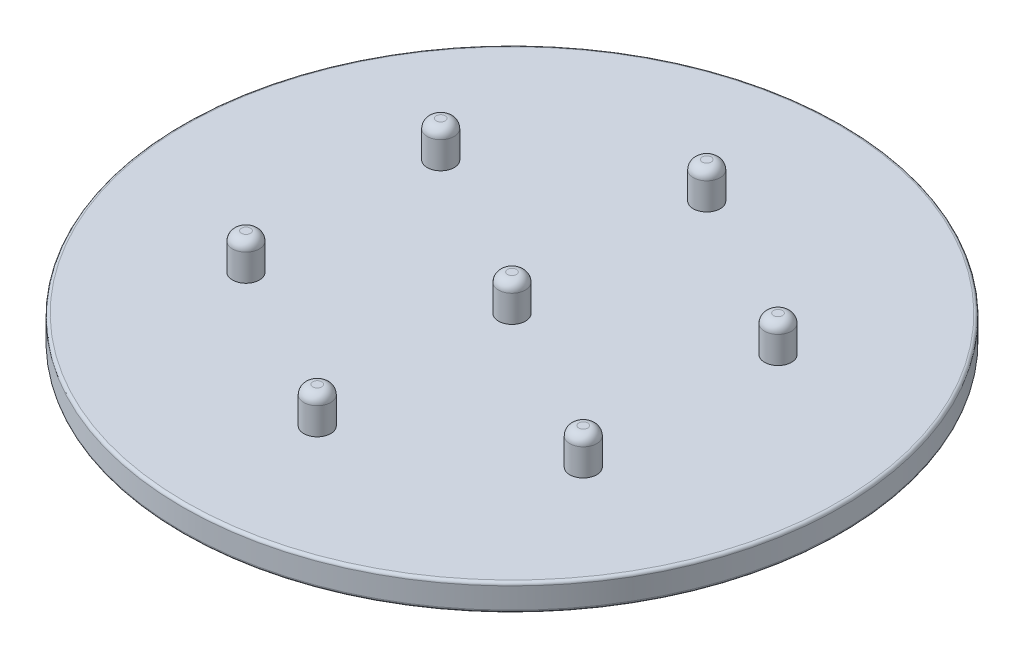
ISO-10303-21;
HEADER;
FILE_DESCRIPTION(('STEP AP214'),'2;1');
FILE_NAME('part.step','',(''),(''),'','','');
FILE_SCHEMA(('AUTOMOTIVE_DESIGN { 1 0 10303 214 1 1 1 1 }'));
ENDSEC;
DATA;
#1=APPLICATION_CONTEXT('core data for automotive mechanical design processes');
#2=APPLICATION_PROTOCOL_DEFINITION('international standard','automotive_design',2000,#1);
#3=PRODUCT_CONTEXT('',#1,'mechanical');
#4=PRODUCT('Part','Part','',(#3));
#5=PRODUCT_RELATED_PRODUCT_CATEGORY('part','',(#4));
#6=PRODUCT_DEFINITION_FORMATION('','',#4);
#7=PRODUCT_DEFINITION_CONTEXT('part definition',#1,'design');
#8=PRODUCT_DEFINITION('design','',#6,#7);
#9=PRODUCT_DEFINITION_SHAPE('','',#8);
#10=(LENGTH_UNIT() NAMED_UNIT(*) SI_UNIT(.MILLI.,.METRE.));
#11=(NAMED_UNIT(*) PLANE_ANGLE_UNIT() SI_UNIT($,.RADIAN.));
#12=(NAMED_UNIT(*) SI_UNIT($,.STERADIAN.) SOLID_ANGLE_UNIT());
#13=UNCERTAINTY_MEASURE_WITH_UNIT(LENGTH_MEASURE(1.E-05),#10,'distance_accuracy_value','');
#14=(GEOMETRIC_REPRESENTATION_CONTEXT(3) GLOBAL_UNCERTAINTY_ASSIGNED_CONTEXT((#13)) GLOBAL_UNIT_ASSIGNED_CONTEXT((#10,
#11,#12)) REPRESENTATION_CONTEXT('',''));
#15=CARTESIAN_POINT('',(0.,0.,0.));
#16=DIRECTION('',(0.,0.,1.));
#17=DIRECTION('',(1.,0.,0.));
#18=AXIS2_PLACEMENT_3D('',#15,#16,#17);
#19=CARTESIAN_POINT('',(0.,-9.,0.));
#20=DIRECTION('',(0.,1.,0.));
#21=DIRECTION('',(0.,0.,1.));
#22=AXIS2_PLACEMENT_3D('',#19,#20,#21);
#23=CYLINDRICAL_SURFACE('',#22,110.);
#24=CARTESIAN_POINT('',(0.,-8.,0.));
#25=DIRECTION('',(0.,1.,0.));
#26=DIRECTION('',(0.,0.,1.));
#27=AXIS2_PLACEMENT_3D('',#24,#25,#26);
#28=CIRCLE('',#27,110.);
#29=CARTESIAN_POINT('',(0.,-8.,110.));
#30=VERTEX_POINT('',#29);
#31=EDGE_CURVE('E45',#30,#30,#28,.T.);
#32=ORIENTED_EDGE('',*,*,#31,.T.);
#33=EDGE_LOOP('',(#32));
#34=FACE_BOUND('',#33,.T.);
#35=CARTESIAN_POINT('',(0.,-0.999999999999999,0.));
#36=DIRECTION('',(0.,1.,0.));
#37=DIRECTION('',(0.,0.,1.));
#38=AXIS2_PLACEMENT_3D('',#35,#36,#37);
#39=CIRCLE('',#38,110.);
#40=CARTESIAN_POINT('',(0.,-0.999999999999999,110.));
#41=VERTEX_POINT('',#40);
#42=EDGE_CURVE('E49',#41,#41,#39,.F.);
#43=ORIENTED_EDGE('',*,*,#42,.T.);
#44=EDGE_LOOP('',(#43));
#45=FACE_BOUND('',#44,.T.);
#46=ADVANCED_FACE('F34',(#34,#45),#23,.T.);
#47=CARTESIAN_POINT('',(0.,-9.,0.));
#48=DIRECTION('',(0.,1.,0.));
#49=DIRECTION('',(0.,0.,1.));
#50=AXIS2_PLACEMENT_3D('',#47,#48,#49);
#51=PLANE('',#50);
#52=CARTESIAN_POINT('',(0.,-9.,0.));
#53=DIRECTION('',(0.,1.,0.));
#54=DIRECTION('',(0.,0.,1.));
#55=AXIS2_PLACEMENT_3D('',#52,#53,#54);
#56=CIRCLE('',#55,109.);
#57=CARTESIAN_POINT('',(0.,-9.,109.));
#58=VERTEX_POINT('',#57);
#59=EDGE_CURVE('E41',#58,#58,#56,.F.);
#60=ORIENTED_EDGE('',*,*,#59,.T.);
#61=EDGE_LOOP('',(#60));
#62=FACE_BOUND('',#61,.T.);
#63=ADVANCED_FACE('F124',(#62),#51,.F.);
#64=CARTESIAN_POINT('',(0.,0.,0.));
#65=DIRECTION('',(0.,1.,0.));
#66=DIRECTION('',(0.,0.,1.));
#67=AXIS2_PLACEMENT_3D('',#64,#65,#66);
#68=PLANE('',#67);
#69=CARTESIAN_POINT('',(0.,0.,0.));
#70=DIRECTION('',(0.,1.,0.));
#71=DIRECTION('',(0.,0.,1.));
#72=AXIS2_PLACEMENT_3D('',#69,#70,#71);
#73=CIRCLE('',#72,109.);
#74=CARTESIAN_POINT('',(0.,0.,109.));
#75=VERTEX_POINT('',#74);
#76=EDGE_CURVE('E10',#75,#75,#73,.T.);
#77=ORIENTED_EDGE('',*,*,#76,.T.);
#78=EDGE_LOOP('',(#77));
#79=FACE_BOUND('',#78,.T.);
#80=CARTESIAN_POINT('',(0.,0.,0.));
#81=DIRECTION('',(0.,1.,0.));
#82=DIRECTION('',(0.,0.,1.));
#83=AXIS2_PLACEMENT_3D('',#80,#81,#82);
#84=CIRCLE('',#83,4.5);
#85=CARTESIAN_POINT('',(0.,0.,4.5));
#86=VERTEX_POINT('',#85);
#87=EDGE_CURVE('E114',#86,#86,#84,.T.);
#88=ORIENTED_EDGE('',*,*,#87,.F.);
#89=EDGE_LOOP('',(#88));
#90=FACE_BOUND('',#89,.T.);
#91=CARTESIAN_POINT('',(0.,0.,65.));
#92=DIRECTION('',(0.,1.,0.));
#93=DIRECTION('',(0.,0.,1.));
#94=AXIS2_PLACEMENT_3D('',#91,#92,#93);
#95=CIRCLE('',#94,4.50000000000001);
#96=CARTESIAN_POINT('',(0.,0.,69.5));
#97=VERTEX_POINT('',#96);
#98=EDGE_CURVE('E111',#97,#97,#95,.T.);
#99=ORIENTED_EDGE('',*,*,#98,.F.);
#100=EDGE_LOOP('',(#99));
#101=FACE_BOUND('',#100,.T.);
#102=CARTESIAN_POINT('',(-56.2916512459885,0.,32.5));
#103=DIRECTION('',(0.,1.,0.));
#104=DIRECTION('',(0.,0.,1.));
#105=AXIS2_PLACEMENT_3D('',#102,#103,#104);
#106=CIRCLE('',#105,4.5);
#107=CARTESIAN_POINT('',(-56.2916512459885,0.,37.));
#108=VERTEX_POINT('',#107);
#109=EDGE_CURVE('E108',#108,#108,#106,.T.);
#110=ORIENTED_EDGE('',*,*,#109,.F.);
#111=EDGE_LOOP('',(#110));
#112=FACE_BOUND('',#111,.T.);
#113=CARTESIAN_POINT('',(56.2916512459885,0.,32.5));
#114=DIRECTION('',(0.,1.,0.));
#115=DIRECTION('',(0.,0.,1.));
#116=AXIS2_PLACEMENT_3D('',#113,#114,#115);
#117=CIRCLE('',#116,4.5);
#118=CARTESIAN_POINT('',(56.2916512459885,0.,37.));
#119=VERTEX_POINT('',#118);
#120=EDGE_CURVE('E105',#119,#119,#117,.T.);
#121=ORIENTED_EDGE('',*,*,#120,.F.);
#122=EDGE_LOOP('',(#121));
#123=FACE_BOUND('',#122,.T.);
#124=CARTESIAN_POINT('',(56.2916512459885,0.,-32.5));
#125=DIRECTION('',(0.,1.,0.));
#126=DIRECTION('',(0.,0.,1.));
#127=AXIS2_PLACEMENT_3D('',#124,#125,#126);
#128=CIRCLE('',#127,4.5);
#129=CARTESIAN_POINT('',(56.2916512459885,0.,-28.));
#130=VERTEX_POINT('',#129);
#131=EDGE_CURVE('E102',#130,#130,#128,.T.);
#132=ORIENTED_EDGE('',*,*,#131,.F.);
#133=EDGE_LOOP('',(#132));
#134=FACE_BOUND('',#133,.T.);
#135=CARTESIAN_POINT('',(-56.2916512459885,0.,-32.5));
#136=DIRECTION('',(0.,1.,0.));
#137=DIRECTION('',(0.,0.,1.));
#138=AXIS2_PLACEMENT_3D('',#135,#136,#137);
#139=CIRCLE('',#138,4.5);
#140=CARTESIAN_POINT('',(-56.2916512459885,0.,-28.));
#141=VERTEX_POINT('',#140);
#142=EDGE_CURVE('E99',#141,#141,#139,.T.);
#143=ORIENTED_EDGE('',*,*,#142,.F.);
#144=EDGE_LOOP('',(#143));
#145=FACE_BOUND('',#144,.T.);
#146=CARTESIAN_POINT('',(0.,0.,-65.));
#147=DIRECTION('',(0.,1.,0.));
#148=DIRECTION('',(0.,0.,1.));
#149=AXIS2_PLACEMENT_3D('',#146,#147,#148);
#150=CIRCLE('',#149,4.50000000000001);
#151=CARTESIAN_POINT('',(0.,0.,-60.5));
#152=VERTEX_POINT('',#151);
#153=EDGE_CURVE('E96',#152,#152,#150,.T.);
#154=ORIENTED_EDGE('',*,*,#153,.F.);
#155=EDGE_LOOP('',(#154));
#156=FACE_BOUND('',#155,.T.);
#157=ADVANCED_FACE('F120',(#79,#90,#101,#112,#123,#134,#145,#156),#68,.T.);
#158=CARTESIAN_POINT('',(0.,12.,-65.));
#159=DIRECTION('',(0.,-1.,0.));
#160=DIRECTION('',(0.,0.,-1.));
#161=AXIS2_PLACEMENT_3D('',#158,#159,#160);
#162=CYLINDRICAL_SURFACE('',#161,4.50000000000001);
#163=CARTESIAN_POINT('',(0.,9.,-65.));
#164=DIRECTION('',(0.,1.,0.));
#165=DIRECTION('',(0.,0.,1.));
#166=AXIS2_PLACEMENT_3D('',#163,#164,#165);
#167=CIRCLE('',#166,4.50000000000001);
#168=CARTESIAN_POINT('',(0.,9.,-60.5));
#169=VERTEX_POINT('',#168);
#170=EDGE_CURVE('E60',#169,#169,#167,.F.);
#171=ORIENTED_EDGE('',*,*,#170,.T.);
#172=EDGE_LOOP('',(#171));
#173=FACE_BOUND('',#172,.T.);
#174=ORIENTED_EDGE('',*,*,#153,.T.);
#175=EDGE_LOOP('',(#174));
#176=FACE_BOUND('',#175,.T.);
#177=ADVANCED_FACE('F123',(#173,#176),#162,.T.);
#178=CARTESIAN_POINT('',(0.,12.,-65.));
#179=DIRECTION('',(0.,1.,0.));
#180=DIRECTION('',(0.,0.,1.));
#181=AXIS2_PLACEMENT_3D('',#178,#179,#180);
#182=PLANE('',#181);
#183=CARTESIAN_POINT('',(0.,12.,-65.));
#184=DIRECTION('',(0.,1.,0.));
#185=DIRECTION('',(0.,0.,1.));
#186=AXIS2_PLACEMENT_3D('',#183,#184,#185);
#187=CIRCLE('',#186,1.50000000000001);
#188=CARTESIAN_POINT('',(0.,12.,-63.5));
#189=VERTEX_POINT('',#188);
#190=EDGE_CURVE('E63',#189,#189,#187,.T.);
#191=ORIENTED_EDGE('',*,*,#190,.T.);
#192=EDGE_LOOP('',(#191));
#193=FACE_BOUND('',#192,.T.);
#194=ADVANCED_FACE('F139',(#193),#182,.T.);
#195=CARTESIAN_POINT('',(-56.2916512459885,12.,-32.5));
#196=DIRECTION('',(0.,-1.,0.));
#197=DIRECTION('',(0.,0.,-1.));
#198=AXIS2_PLACEMENT_3D('',#195,#196,#197);
#199=CYLINDRICAL_SURFACE('',#198,4.5);
#200=CARTESIAN_POINT('',(-56.2916512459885,9.,-32.5));
#201=DIRECTION('',(0.,1.,0.));
#202=DIRECTION('',(0.,0.,1.));
#203=AXIS2_PLACEMENT_3D('',#200,#201,#202);
#204=CIRCLE('',#203,4.5);
#205=CARTESIAN_POINT('',(-56.2916512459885,9.,-28.));
#206=VERTEX_POINT('',#205);
#207=EDGE_CURVE('E54',#206,#206,#204,.F.);
#208=ORIENTED_EDGE('',*,*,#207,.T.);
#209=EDGE_LOOP('',(#208));
#210=FACE_BOUND('',#209,.T.);
#211=ORIENTED_EDGE('',*,*,#142,.T.);
#212=EDGE_LOOP('',(#211));
#213=FACE_BOUND('',#212,.T.);
#214=ADVANCED_FACE('F145',(#210,#213),#199,.T.);
#215=CARTESIAN_POINT('',(-56.2916512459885,12.,-32.5));
#216=DIRECTION('',(0.,1.,0.));
#217=DIRECTION('',(0.,0.,1.));
#218=AXIS2_PLACEMENT_3D('',#215,#216,#217);
#219=PLANE('',#218);
#220=CARTESIAN_POINT('',(-56.2916512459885,12.,-32.5));
#221=DIRECTION('',(0.,1.,0.));
#222=DIRECTION('',(0.,0.,1.));
#223=AXIS2_PLACEMENT_3D('',#220,#221,#222);
#224=CIRCLE('',#223,1.5);
#225=CARTESIAN_POINT('',(-56.2916512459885,12.,-31.));
#226=VERTEX_POINT('',#225);
#227=EDGE_CURVE('E57',#226,#226,#224,.T.);
#228=ORIENTED_EDGE('',*,*,#227,.T.);
#229=EDGE_LOOP('',(#228));
#230=FACE_BOUND('',#229,.T.);
#231=ADVANCED_FACE('F320',(#230),#219,.T.);
#232=CARTESIAN_POINT('',(56.2916512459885,12.,-32.5));
#233=DIRECTION('',(0.,-1.,0.));
#234=DIRECTION('',(0.,0.,-1.));
#235=AXIS2_PLACEMENT_3D('',#232,#233,#234);
#236=CYLINDRICAL_SURFACE('',#235,4.5);
#237=CARTESIAN_POINT('',(56.2916512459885,9.,-32.5));
#238=DIRECTION('',(0.,1.,0.));
#239=DIRECTION('',(0.,0.,1.));
#240=AXIS2_PLACEMENT_3D('',#237,#238,#239);
#241=CIRCLE('',#240,4.5);
#242=CARTESIAN_POINT('',(56.2916512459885,9.,-28.));
#243=VERTEX_POINT('',#242);
#244=EDGE_CURVE('E66',#243,#243,#241,.F.);
#245=ORIENTED_EDGE('',*,*,#244,.T.);
#246=EDGE_LOOP('',(#245));
#247=FACE_BOUND('',#246,.T.);
#248=ORIENTED_EDGE('',*,*,#131,.T.);
#249=EDGE_LOOP('',(#248));
#250=FACE_BOUND('',#249,.T.);
#251=ADVANCED_FACE('F310',(#247,#250),#236,.T.);
#252=CARTESIAN_POINT('',(56.2916512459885,12.,-32.5));
#253=DIRECTION('',(0.,1.,0.));
#254=DIRECTION('',(0.,0.,1.));
#255=AXIS2_PLACEMENT_3D('',#252,#253,#254);
#256=PLANE('',#255);
#257=CARTESIAN_POINT('',(56.2916512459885,12.,-32.5));
#258=DIRECTION('',(0.,1.,0.));
#259=DIRECTION('',(0.,0.,1.));
#260=AXIS2_PLACEMENT_3D('',#257,#258,#259);
#261=CIRCLE('',#260,1.5);
#262=CARTESIAN_POINT('',(56.2916512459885,12.,-31.));
#263=VERTEX_POINT('',#262);
#264=EDGE_CURVE('E69',#263,#263,#261,.T.);
#265=ORIENTED_EDGE('',*,*,#264,.T.);
#266=EDGE_LOOP('',(#265));
#267=FACE_BOUND('',#266,.T.);
#268=ADVANCED_FACE('F300',(#267),#256,.T.);
#269=CARTESIAN_POINT('',(56.2916512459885,12.,32.5));
#270=DIRECTION('',(0.,-1.,0.));
#271=DIRECTION('',(0.,0.,-1.));
#272=AXIS2_PLACEMENT_3D('',#269,#270,#271);
#273=CYLINDRICAL_SURFACE('',#272,4.5);
#274=CARTESIAN_POINT('',(56.2916512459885,9.,32.5));
#275=DIRECTION('',(0.,1.,0.));
#276=DIRECTION('',(0.,0.,1.));
#277=AXIS2_PLACEMENT_3D('',#274,#275,#276);
#278=CIRCLE('',#277,4.5);
#279=CARTESIAN_POINT('',(56.2916512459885,9.,37.));
#280=VERTEX_POINT('',#279);
#281=EDGE_CURVE('E72',#280,#280,#278,.F.);
#282=ORIENTED_EDGE('',*,*,#281,.T.);
#283=EDGE_LOOP('',(#282));
#284=FACE_BOUND('',#283,.T.);
#285=ORIENTED_EDGE('',*,*,#120,.T.);
#286=EDGE_LOOP('',(#285));
#287=FACE_BOUND('',#286,.T.);
#288=ADVANCED_FACE('F290',(#284,#287),#273,.T.);
#289=CARTESIAN_POINT('',(56.2916512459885,12.,32.5));
#290=DIRECTION('',(0.,1.,0.));
#291=DIRECTION('',(0.,0.,1.));
#292=AXIS2_PLACEMENT_3D('',#289,#290,#291);
#293=PLANE('',#292);
#294=CARTESIAN_POINT('',(56.2916512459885,12.,32.5));
#295=DIRECTION('',(0.,1.,0.));
#296=DIRECTION('',(0.,0.,1.));
#297=AXIS2_PLACEMENT_3D('',#294,#295,#296);
#298=CIRCLE('',#297,1.5);
#299=CARTESIAN_POINT('',(56.2916512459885,12.,34.));
#300=VERTEX_POINT('',#299);
#301=EDGE_CURVE('E75',#300,#300,#298,.T.);
#302=ORIENTED_EDGE('',*,*,#301,.T.);
#303=EDGE_LOOP('',(#302));
#304=FACE_BOUND('',#303,.T.);
#305=ADVANCED_FACE('F280',(#304),#293,.T.);
#306=CARTESIAN_POINT('',(-56.2916512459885,12.,32.5));
#307=DIRECTION('',(0.,-1.,0.));
#308=DIRECTION('',(0.,0.,-1.));
#309=AXIS2_PLACEMENT_3D('',#306,#307,#308);
#310=CYLINDRICAL_SURFACE('',#309,4.5);
#311=CARTESIAN_POINT('',(-56.2916512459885,9.,32.5));
#312=DIRECTION('',(0.,1.,0.));
#313=DIRECTION('',(0.,0.,1.));
#314=AXIS2_PLACEMENT_3D('',#311,#312,#313);
#315=CIRCLE('',#314,4.5);
#316=CARTESIAN_POINT('',(-56.2916512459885,9.,37.));
#317=VERTEX_POINT('',#316);
#318=EDGE_CURVE('E84',#317,#317,#315,.F.);
#319=ORIENTED_EDGE('',*,*,#318,.T.);
#320=EDGE_LOOP('',(#319));
#321=FACE_BOUND('',#320,.T.);
#322=ORIENTED_EDGE('',*,*,#109,.T.);
#323=EDGE_LOOP('',(#322));
#324=FACE_BOUND('',#323,.T.);
#325=ADVANCED_FACE('F270',(#321,#324),#310,.T.);
#326=CARTESIAN_POINT('',(-56.2916512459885,12.,32.5));
#327=DIRECTION('',(0.,1.,0.));
#328=DIRECTION('',(0.,0.,1.));
#329=AXIS2_PLACEMENT_3D('',#326,#327,#328);
#330=PLANE('',#329);
#331=CARTESIAN_POINT('',(-56.2916512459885,12.,32.5));
#332=DIRECTION('',(0.,1.,0.));
#333=DIRECTION('',(0.,0.,1.));
#334=AXIS2_PLACEMENT_3D('',#331,#332,#333);
#335=CIRCLE('',#334,1.5);
#336=CARTESIAN_POINT('',(-56.2916512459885,12.,34.));
#337=VERTEX_POINT('',#336);
#338=EDGE_CURVE('E87',#337,#337,#335,.T.);
#339=ORIENTED_EDGE('',*,*,#338,.T.);
#340=EDGE_LOOP('',(#339));
#341=FACE_BOUND('',#340,.T.);
#342=ADVANCED_FACE('F260',(#341),#330,.T.);
#343=CARTESIAN_POINT('',(0.,12.,65.));
#344=DIRECTION('',(0.,-1.,0.));
#345=DIRECTION('',(0.,0.,-1.));
#346=AXIS2_PLACEMENT_3D('',#343,#344,#345);
#347=CYLINDRICAL_SURFACE('',#346,4.50000000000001);
#348=CARTESIAN_POINT('',(0.,9.,65.));
#349=DIRECTION('',(0.,1.,0.));
#350=DIRECTION('',(0.,0.,1.));
#351=AXIS2_PLACEMENT_3D('',#348,#349,#350);
#352=CIRCLE('',#351,4.50000000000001);
#353=CARTESIAN_POINT('',(0.,9.,69.5));
#354=VERTEX_POINT('',#353);
#355=EDGE_CURVE('E90',#354,#354,#352,.F.);
#356=ORIENTED_EDGE('',*,*,#355,.T.);
#357=EDGE_LOOP('',(#356));
#358=FACE_BOUND('',#357,.T.);
#359=ORIENTED_EDGE('',*,*,#98,.T.);
#360=EDGE_LOOP('',(#359));
#361=FACE_BOUND('',#360,.T.);
#362=ADVANCED_FACE('F250',(#358,#361),#347,.T.);
#363=CARTESIAN_POINT('',(0.,12.,65.));
#364=DIRECTION('',(0.,1.,0.));
#365=DIRECTION('',(0.,0.,1.));
#366=AXIS2_PLACEMENT_3D('',#363,#364,#365);
#367=PLANE('',#366);
#368=CARTESIAN_POINT('',(0.,12.,65.));
#369=DIRECTION('',(0.,1.,0.));
#370=DIRECTION('',(0.,0.,1.));
#371=AXIS2_PLACEMENT_3D('',#368,#369,#370);
#372=CIRCLE('',#371,1.50000000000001);
#373=CARTESIAN_POINT('',(0.,12.,66.5));
#374=VERTEX_POINT('',#373);
#375=EDGE_CURVE('E93',#374,#374,#372,.T.);
#376=ORIENTED_EDGE('',*,*,#375,.T.);
#377=EDGE_LOOP('',(#376));
#378=FACE_BOUND('',#377,.T.);
#379=ADVANCED_FACE('F240',(#378),#367,.T.);
#380=CARTESIAN_POINT('',(0.,12.,0.));
#381=DIRECTION('',(0.,-1.,0.));
#382=DIRECTION('',(0.,0.,-1.));
#383=AXIS2_PLACEMENT_3D('',#380,#381,#382);
#384=CYLINDRICAL_SURFACE('',#383,4.5);
#385=CARTESIAN_POINT('',(0.,9.,0.));
#386=DIRECTION('',(0.,1.,0.));
#387=DIRECTION('',(0.,0.,1.));
#388=AXIS2_PLACEMENT_3D('',#385,#386,#387);
#389=CIRCLE('',#388,4.5);
#390=CARTESIAN_POINT('',(0.,9.,4.5));
#391=VERTEX_POINT('',#390);
#392=EDGE_CURVE('E78',#391,#391,#389,.F.);
#393=ORIENTED_EDGE('',*,*,#392,.T.);
#394=EDGE_LOOP('',(#393));
#395=FACE_BOUND('',#394,.T.);
#396=ORIENTED_EDGE('',*,*,#87,.T.);
#397=EDGE_LOOP('',(#396));
#398=FACE_BOUND('',#397,.T.);
#399=ADVANCED_FACE('F118',(#395,#398),#384,.T.);
#400=CARTESIAN_POINT('',(0.,12.,0.));
#401=DIRECTION('',(0.,1.,0.));
#402=DIRECTION('',(0.,0.,1.));
#403=AXIS2_PLACEMENT_3D('',#400,#401,#402);
#404=PLANE('',#403);
#405=CARTESIAN_POINT('',(0.,12.,0.));
#406=DIRECTION('',(0.,1.,0.));
#407=DIRECTION('',(0.,0.,1.));
#408=AXIS2_PLACEMENT_3D('',#405,#406,#407);
#409=CIRCLE('',#408,1.5);
#410=CARTESIAN_POINT('',(0.,12.,1.5));
#411=VERTEX_POINT('',#410);
#412=EDGE_CURVE('E81',#411,#411,#409,.T.);
#413=ORIENTED_EDGE('',*,*,#412,.T.);
#414=EDGE_LOOP('',(#413));
#415=FACE_BOUND('',#414,.T.);
#416=ADVANCED_FACE('F161',(#415),#404,.T.);
#417=CARTESIAN_POINT('',(0.,9.,65.));
#418=DIRECTION('',(0.,1.,0.));
#419=DIRECTION('',(0.,0.,1.));
#420=AXIS2_PLACEMENT_3D('',#417,#418,#419);
#421=DEGENERATE_TOROIDAL_SURFACE('',#420,1.50000000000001,3.,.T.);
#422=ORIENTED_EDGE('',*,*,#355,.F.);
#423=EDGE_LOOP('',(#422));
#424=FACE_BOUND('',#423,.T.);
#425=ORIENTED_EDGE('',*,*,#375,.F.);
#426=EDGE_LOOP('',(#425));
#427=FACE_BOUND('',#426,.T.);
#428=ADVANCED_FACE('F157',(#424,#427),#421,.T.);
#429=CARTESIAN_POINT('',(-56.2916512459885,9.,32.5));
#430=DIRECTION('',(0.,1.,0.));
#431=DIRECTION('',(0.,0.,1.));
#432=AXIS2_PLACEMENT_3D('',#429,#430,#431);
#433=DEGENERATE_TOROIDAL_SURFACE('',#432,1.5,3.,.T.);
#434=ORIENTED_EDGE('',*,*,#318,.F.);
#435=EDGE_LOOP('',(#434));
#436=FACE_BOUND('',#435,.T.);
#437=ORIENTED_EDGE('',*,*,#338,.F.);
#438=EDGE_LOOP('',(#437));
#439=FACE_BOUND('',#438,.T.);
#440=ADVANCED_FACE('F160',(#436,#439),#433,.T.);
#441=CARTESIAN_POINT('',(0.,9.,0.));
#442=DIRECTION('',(0.,1.,0.));
#443=DIRECTION('',(0.,0.,1.));
#444=AXIS2_PLACEMENT_3D('',#441,#442,#443);
#445=DEGENERATE_TOROIDAL_SURFACE('',#444,1.5,3.,.T.);
#446=ORIENTED_EDGE('',*,*,#392,.F.);
#447=EDGE_LOOP('',(#446));
#448=FACE_BOUND('',#447,.T.);
#449=ORIENTED_EDGE('',*,*,#412,.F.);
#450=EDGE_LOOP('',(#449));
#451=FACE_BOUND('',#450,.T.);
#452=ADVANCED_FACE('F165',(#448,#451),#445,.T.);
#453=CARTESIAN_POINT('',(56.2916512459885,9.,32.5));
#454=DIRECTION('',(0.,1.,0.));
#455=DIRECTION('',(0.,0.,1.));
#456=AXIS2_PLACEMENT_3D('',#453,#454,#455);
#457=DEGENERATE_TOROIDAL_SURFACE('',#456,1.5,3.,.T.);
#458=ORIENTED_EDGE('',*,*,#281,.F.);
#459=EDGE_LOOP('',(#458));
#460=FACE_BOUND('',#459,.T.);
#461=ORIENTED_EDGE('',*,*,#301,.F.);
#462=EDGE_LOOP('',(#461));
#463=FACE_BOUND('',#462,.T.);
#464=ADVANCED_FACE('F169',(#460,#463),#457,.T.);
#465=CARTESIAN_POINT('',(56.2916512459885,9.,-32.5));
#466=DIRECTION('',(0.,1.,0.));
#467=DIRECTION('',(0.,0.,1.));
#468=AXIS2_PLACEMENT_3D('',#465,#466,#467);
#469=DEGENERATE_TOROIDAL_SURFACE('',#468,1.5,3.,.T.);
#470=ORIENTED_EDGE('',*,*,#244,.F.);
#471=EDGE_LOOP('',(#470));
#472=FACE_BOUND('',#471,.T.);
#473=ORIENTED_EDGE('',*,*,#264,.F.);
#474=EDGE_LOOP('',(#473));
#475=FACE_BOUND('',#474,.T.);
#476=ADVANCED_FACE('F173',(#472,#475),#469,.T.);
#477=CARTESIAN_POINT('',(0.,9.,-65.));
#478=DIRECTION('',(0.,1.,0.));
#479=DIRECTION('',(0.,0.,1.));
#480=AXIS2_PLACEMENT_3D('',#477,#478,#479);
#481=DEGENERATE_TOROIDAL_SURFACE('',#480,1.50000000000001,3.,.T.);
#482=ORIENTED_EDGE('',*,*,#170,.F.);
#483=EDGE_LOOP('',(#482));
#484=FACE_BOUND('',#483,.T.);
#485=ORIENTED_EDGE('',*,*,#190,.F.);
#486=EDGE_LOOP('',(#485));
#487=FACE_BOUND('',#486,.T.);
#488=ADVANCED_FACE('F177',(#484,#487),#481,.T.);
#489=CARTESIAN_POINT('',(-56.2916512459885,9.,-32.5));
#490=DIRECTION('',(0.,1.,0.));
#491=DIRECTION('',(0.,0.,1.));
#492=AXIS2_PLACEMENT_3D('',#489,#490,#491);
#493=DEGENERATE_TOROIDAL_SURFACE('',#492,1.5,3.,.T.);
#494=ORIENTED_EDGE('',*,*,#207,.F.);
#495=EDGE_LOOP('',(#494));
#496=FACE_BOUND('',#495,.T.);
#497=ORIENTED_EDGE('',*,*,#227,.F.);
#498=EDGE_LOOP('',(#497));
#499=FACE_BOUND('',#498,.T.);
#500=ADVANCED_FACE('F181',(#496,#499),#493,.T.);
#501=CARTESIAN_POINT('',(0.,-8.,0.));
#502=DIRECTION('',(0.,1.,0.));
#503=DIRECTION('',(0.,0.,1.));
#504=AXIS2_PLACEMENT_3D('',#501,#502,#503);
#505=TOROIDAL_SURFACE('',#504,109.,1.);
#506=ORIENTED_EDGE('',*,*,#59,.F.);
#507=EDGE_LOOP('',(#506));
#508=FACE_BOUND('',#507,.T.);
#509=ORIENTED_EDGE('',*,*,#31,.F.);
#510=EDGE_LOOP('',(#509));
#511=FACE_BOUND('',#510,.T.);
#512=ADVANCED_FACE('F184',(#508,#511),#505,.T.);
#513=CARTESIAN_POINT('',(0.,-0.999999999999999,0.));
#514=DIRECTION('',(0.,1.,0.));
#515=DIRECTION('',(0.,0.,1.));
#516=AXIS2_PLACEMENT_3D('',#513,#514,#515);
#517=TOROIDAL_SURFACE('',#516,109.,1.);
#518=ORIENTED_EDGE('',*,*,#42,.F.);
#519=EDGE_LOOP('',(#518));
#520=FACE_BOUND('',#519,.T.);
#521=ORIENTED_EDGE('',*,*,#76,.F.);
#522=EDGE_LOOP('',(#521));
#523=FACE_BOUND('',#522,.T.);
#524=ADVANCED_FACE('F36',(#520,#523),#517,.T.);
#525=CLOSED_SHELL('',(#46,#63,#157,#177,#194,#214,#231,#251,#268,#288,#305,#325,#342,#362,#379,
#399,#416,#428,#440,#452,#464,#476,#488,#500,#512,#524));
#526=MANIFOLD_SOLID_BREP('B2',#525);
#527=ADVANCED_BREP_SHAPE_REPRESENTATION('',(#18,#526),#14);
#528=SHAPE_DEFINITION_REPRESENTATION(#9,#527);
ENDSEC;
END-ISO-10303-21;
